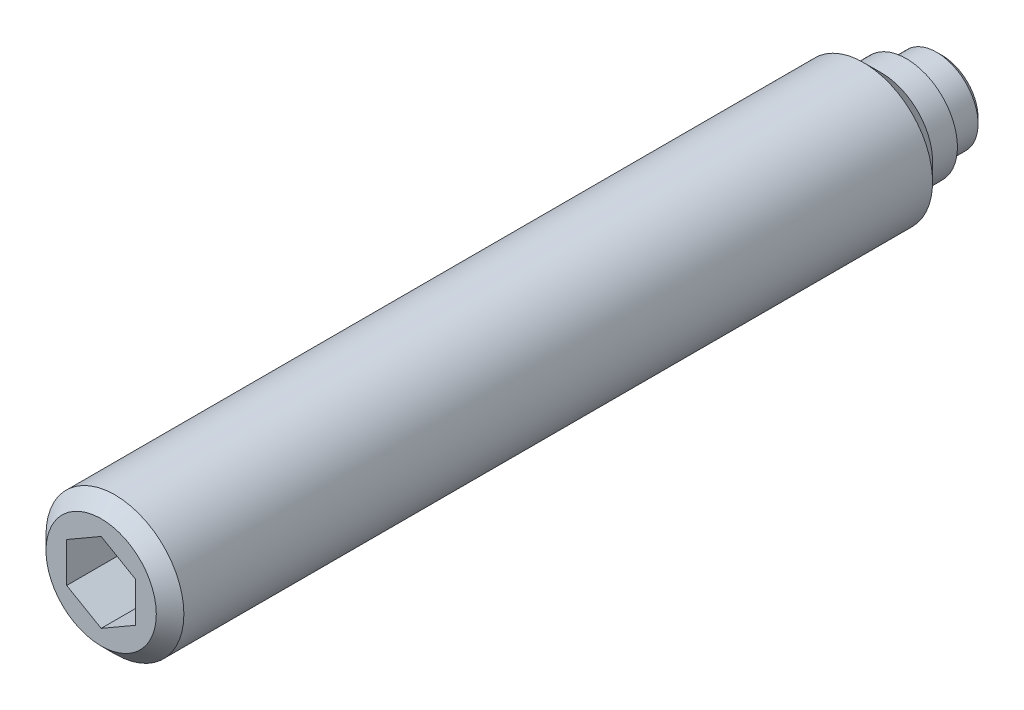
ISO-10303-21;
HEADER;
FILE_DESCRIPTION(('STEP AP214'),'2;1');
FILE_NAME('part.step','',(''),(''),'','','');
FILE_SCHEMA(('AUTOMOTIVE_DESIGN { 1 0 10303 214 1 1 1 1 }'));
ENDSEC;
DATA;
#1=APPLICATION_CONTEXT('core data for automotive mechanical design processes');
#2=APPLICATION_PROTOCOL_DEFINITION('international standard','automotive_design',2000,#1);
#3=PRODUCT_CONTEXT('',#1,'mechanical');
#4=PRODUCT('Part','Part','',(#3));
#5=PRODUCT_RELATED_PRODUCT_CATEGORY('part','',(#4));
#6=PRODUCT_DEFINITION_FORMATION('','',#4);
#7=PRODUCT_DEFINITION_CONTEXT('part definition',#1,'design');
#8=PRODUCT_DEFINITION('design','',#6,#7);
#9=PRODUCT_DEFINITION_SHAPE('','',#8);
#10=(LENGTH_UNIT() NAMED_UNIT(*) SI_UNIT(.MILLI.,.METRE.));
#11=(NAMED_UNIT(*) PLANE_ANGLE_UNIT() SI_UNIT($,.RADIAN.));
#12=(NAMED_UNIT(*) SI_UNIT($,.STERADIAN.) SOLID_ANGLE_UNIT());
#13=UNCERTAINTY_MEASURE_WITH_UNIT(LENGTH_MEASURE(1.E-05),#10,'distance_accuracy_value','');
#14=(GEOMETRIC_REPRESENTATION_CONTEXT(3) GLOBAL_UNCERTAINTY_ASSIGNED_CONTEXT((#13)) GLOBAL_UNIT_ASSIGNED_CONTEXT((#10,
#11,#12)) REPRESENTATION_CONTEXT('',''));
#15=CARTESIAN_POINT('',(0.,0.,0.));
#16=DIRECTION('',(0.,0.,1.));
#17=DIRECTION('',(1.,0.,0.));
#18=AXIS2_PLACEMENT_3D('',#15,#16,#17);
#19=CARTESIAN_POINT('',(0.,0.,1.3));
#20=DIRECTION('',(0.,0.,-1.));
#21=DIRECTION('',(-1.,0.,0.));
#22=AXIS2_PLACEMENT_3D('',#19,#20,#21);
#23=CYLINDRICAL_SURFACE('',#22,2.5);
#24=CARTESIAN_POINT('',(0.,0.,2.85));
#25=DIRECTION('',(0.,0.,-1.));
#26=DIRECTION('',(-1.,0.,0.));
#27=AXIS2_PLACEMENT_3D('',#24,#25,#26);
#28=CIRCLE('',#27,2.5);
#29=CARTESIAN_POINT('',(-2.5,0.,2.85));
#30=VERTEX_POINT('',#29);
#31=EDGE_CURVE('E9',#30,#30,#28,.T.);
#32=ORIENTED_EDGE('',*,*,#31,.F.);
#33=EDGE_LOOP('',(#32));
#34=FACE_BOUND('',#33,.T.);
#35=CARTESIAN_POINT('',(0.,0.,30.));
#36=DIRECTION('',(0.,0.,1.));
#37=DIRECTION('',(1.,0.,0.));
#38=AXIS2_PLACEMENT_3D('',#35,#36,#37);
#39=CIRCLE('',#38,2.5);
#40=CARTESIAN_POINT('',(2.5,0.,30.));
#41=VERTEX_POINT('',#40);
#42=EDGE_CURVE('E115',#41,#41,#39,.T.);
#43=ORIENTED_EDGE('',*,*,#42,.F.);
#44=EDGE_LOOP('',(#43));
#45=FACE_BOUND('',#44,.T.);
#46=ADVANCED_FACE('F14',(#34,#45),#23,.T.);
#47=CARTESIAN_POINT('',(0.,0.,2.85));
#48=DIRECTION('',(0.,0.,1.));
#49=DIRECTION('',(1.,0.,0.));
#50=AXIS2_PLACEMENT_3D('',#47,#48,#49);
#51=CONICAL_SURFACE('',#50,2.5,0.785398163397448);
#52=ORIENTED_EDGE('',*,*,#31,.T.);
#53=EDGE_LOOP('',(#52));
#54=FACE_BOUND('',#53,.T.);
#55=CARTESIAN_POINT('',(0.,0.,2.2));
#56=DIRECTION('',(0.,0.,-1.));
#57=DIRECTION('',(-1.,0.,0.));
#58=AXIS2_PLACEMENT_3D('',#55,#56,#57);
#59=CIRCLE('',#58,1.85);
#60=CARTESIAN_POINT('',(-1.85,0.,2.2));
#61=VERTEX_POINT('',#60);
#62=EDGE_CURVE('E21',#61,#61,#59,.T.);
#63=ORIENTED_EDGE('',*,*,#62,.F.);
#64=EDGE_LOOP('',(#63));
#65=FACE_BOUND('',#64,.T.);
#66=ADVANCED_FACE('F143',(#54,#65),#51,.T.);
#67=CARTESIAN_POINT('',(0.,0.,1.3));
#68=DIRECTION('',(0.,0.,-1.));
#69=DIRECTION('',(-1.,0.,0.));
#70=AXIS2_PLACEMENT_3D('',#67,#68,#69);
#71=CYLINDRICAL_SURFACE('',#70,1.85);
#72=ORIENTED_EDGE('',*,*,#62,.T.);
#73=EDGE_LOOP('',(#72));
#74=FACE_BOUND('',#73,.T.);
#75=CARTESIAN_POINT('',(0.,0.,1.3));
#76=DIRECTION('',(0.,0.,-1.));
#77=DIRECTION('',(-1.,0.,0.));
#78=AXIS2_PLACEMENT_3D('',#75,#76,#77);
#79=CIRCLE('',#78,1.85);
#80=CARTESIAN_POINT('',(-1.85,0.,1.3));
#81=VERTEX_POINT('',#80);
#82=EDGE_CURVE('E135',#81,#81,#79,.T.);
#83=ORIENTED_EDGE('',*,*,#82,.F.);
#84=EDGE_LOOP('',(#83));
#85=FACE_BOUND('',#84,.T.);
#86=ADVANCED_FACE('F140',(#74,#85),#71,.T.);
#87=CARTESIAN_POINT('',(0.,1.85,1.3));
#88=DIRECTION('',(0.,0.,1.));
#89=DIRECTION('',(1.,0.,0.));
#90=AXIS2_PLACEMENT_3D('',#87,#88,#89);
#91=PLANE('',#90);
#92=ORIENTED_EDGE('',*,*,#82,.T.);
#93=EDGE_LOOP('',(#92));
#94=FACE_BOUND('',#93,.T.);
#95=CARTESIAN_POINT('',(0.,0.,1.3));
#96=DIRECTION('',(0.,0.,-1.));
#97=DIRECTION('',(-1.,0.,0.));
#98=AXIS2_PLACEMENT_3D('',#95,#96,#97);
#99=CIRCLE('',#98,1.5);
#100=CARTESIAN_POINT('',(-1.5,0.,1.3));
#101=VERTEX_POINT('',#100);
#102=EDGE_CURVE('E132',#101,#101,#99,.T.);
#103=ORIENTED_EDGE('',*,*,#102,.F.);
#104=EDGE_LOOP('',(#103));
#105=FACE_BOUND('',#104,.T.);
#106=ADVANCED_FACE('F151',(#94,#105),#91,.F.);
#107=CARTESIAN_POINT('',(0.,0.,0.));
#108=DIRECTION('',(0.,0.,-1.));
#109=DIRECTION('',(-1.,0.,0.));
#110=AXIS2_PLACEMENT_3D('',#107,#108,#109);
#111=CYLINDRICAL_SURFACE('',#110,1.5);
#112=CARTESIAN_POINT('',(0.,0.,0.2));
#113=DIRECTION('',(0.,0.,-1.));
#114=DIRECTION('',(-1.,0.,0.));
#115=AXIS2_PLACEMENT_3D('',#112,#113,#114);
#116=CIRCLE('',#115,1.5);
#117=CARTESIAN_POINT('',(-1.5,0.,0.2));
#118=VERTEX_POINT('',#117);
#119=EDGE_CURVE('E129',#118,#118,#116,.T.);
#120=ORIENTED_EDGE('',*,*,#119,.F.);
#121=EDGE_LOOP('',(#120));
#122=FACE_BOUND('',#121,.T.);
#123=ORIENTED_EDGE('',*,*,#102,.T.);
#124=EDGE_LOOP('',(#123));
#125=FACE_BOUND('',#124,.T.);
#126=ADVANCED_FACE('F157',(#122,#125),#111,.T.);
#127=CARTESIAN_POINT('',(0.,0.,0.2));
#128=DIRECTION('',(0.,0.,1.));
#129=DIRECTION('',(1.,0.,0.));
#130=AXIS2_PLACEMENT_3D('',#127,#128,#129);
#131=CONICAL_SURFACE('',#130,1.5,0.785398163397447);
#132=CARTESIAN_POINT('',(0.,0.,0.));
#133=DIRECTION('',(0.,0.,-1.));
#134=DIRECTION('',(-1.,0.,0.));
#135=AXIS2_PLACEMENT_3D('',#132,#133,#134);
#136=CIRCLE('',#135,1.3);
#137=CARTESIAN_POINT('',(-1.3,0.,0.));
#138=VERTEX_POINT('',#137);
#139=EDGE_CURVE('E126',#138,#138,#136,.T.);
#140=ORIENTED_EDGE('',*,*,#139,.F.);
#141=EDGE_LOOP('',(#140));
#142=FACE_BOUND('',#141,.T.);
#143=ORIENTED_EDGE('',*,*,#119,.T.);
#144=EDGE_LOOP('',(#143));
#145=FACE_BOUND('',#144,.T.);
#146=ADVANCED_FACE('F161',(#142,#145),#131,.T.);
#147=CARTESIAN_POINT('',(0.,1.3,0.));
#148=DIRECTION('',(0.,0.,1.));
#149=DIRECTION('',(1.,0.,0.));
#150=AXIS2_PLACEMENT_3D('',#147,#148,#149);
#151=PLANE('',#150);
#152=ORIENTED_EDGE('',*,*,#139,.T.);
#153=EDGE_LOOP('',(#152));
#154=FACE_BOUND('',#153,.T.);
#155=ADVANCED_FACE('F165',(#154),#151,.F.);
#156=CARTESIAN_POINT('',(0.,0.,30.5));
#157=DIRECTION('',(0.,0.,1.));
#158=DIRECTION('',(1.,0.,0.));
#159=AXIS2_PLACEMENT_3D('',#156,#157,#158);
#160=PLANE('',#159);
#161=DIRECTION('',(0.866025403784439,-0.5,0.));
#162=VECTOR('',#161,1.);
#163=CARTESIAN_POINT('',(-1.25,-0.721687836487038,30.5));
#164=LINE('',#163,#162);
#165=CARTESIAN_POINT('',(-1.25,-0.721687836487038,30.5));
#166=VERTEX_POINT('',#165);
#167=CARTESIAN_POINT('',(0.,-1.44337567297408,30.5));
#168=VERTEX_POINT('',#167);
#169=EDGE_CURVE('E28',#166,#168,#164,.T.);
#170=ORIENTED_EDGE('',*,*,#169,.F.);
#171=DIRECTION('',(0.,-1.,0.));
#172=VECTOR('',#171,1.);
#173=CARTESIAN_POINT('',(-1.25,0.721687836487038,30.5));
#174=LINE('',#173,#172);
#175=CARTESIAN_POINT('',(-1.25,0.721687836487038,30.5));
#176=VERTEX_POINT('',#175);
#177=EDGE_CURVE('E111',#176,#166,#174,.T.);
#178=ORIENTED_EDGE('',*,*,#177,.F.);
#179=DIRECTION('',(-0.866025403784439,-0.5,0.));
#180=VECTOR('',#179,1.);
#181=CARTESIAN_POINT('',(0.,1.44337567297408,30.5));
#182=LINE('',#181,#180);
#183=CARTESIAN_POINT('',(0.,1.44337567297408,30.5));
#184=VERTEX_POINT('',#183);
#185=EDGE_CURVE('E109',#184,#176,#182,.T.);
#186=ORIENTED_EDGE('',*,*,#185,.F.);
#187=DIRECTION('',(-0.866025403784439,0.5,0.));
#188=VECTOR('',#187,1.);
#189=CARTESIAN_POINT('',(1.25,0.721687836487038,30.5));
#190=LINE('',#189,#188);
#191=CARTESIAN_POINT('',(1.25,0.721687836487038,30.5));
#192=VERTEX_POINT('',#191);
#193=EDGE_CURVE('E76',#192,#184,#190,.T.);
#194=ORIENTED_EDGE('',*,*,#193,.F.);
#195=DIRECTION('',(0.,1.,0.));
#196=VECTOR('',#195,1.);
#197=CARTESIAN_POINT('',(1.25,-0.721687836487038,30.5));
#198=LINE('',#197,#196);
#199=CARTESIAN_POINT('',(1.25,-0.721687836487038,30.5));
#200=VERTEX_POINT('',#199);
#201=EDGE_CURVE('E105',#200,#192,#198,.T.);
#202=ORIENTED_EDGE('',*,*,#201,.F.);
#203=DIRECTION('',(0.866025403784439,0.5,0.));
#204=VECTOR('',#203,1.);
#205=CARTESIAN_POINT('',(0.,-1.44337567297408,30.5));
#206=LINE('',#205,#204);
#207=EDGE_CURVE('E102',#168,#200,#206,.T.);
#208=ORIENTED_EDGE('',*,*,#207,.F.);
#209=EDGE_LOOP('',(#170,#178,#186,#194,#202,#208));
#210=FACE_BOUND('',#209,.T.);
#211=CARTESIAN_POINT('',(0.,0.,30.5));
#212=DIRECTION('',(0.,0.,1.));
#213=DIRECTION('',(1.,0.,0.));
#214=AXIS2_PLACEMENT_3D('',#211,#212,#213);
#215=CIRCLE('',#214,2.);
#216=CARTESIAN_POINT('',(2.,0.,30.5));
#217=VERTEX_POINT('',#216);
#218=EDGE_CURVE('E123',#217,#217,#215,.T.);
#219=ORIENTED_EDGE('',*,*,#218,.T.);
#220=EDGE_LOOP('',(#219));
#221=FACE_BOUND('',#220,.T.);
#222=ADVANCED_FACE('F169',(#210,#221),#160,.T.);
#223=CARTESIAN_POINT('',(0.,0.,30.5));
#224=DIRECTION('',(0.,0.,-1.));
#225=DIRECTION('',(-1.,0.,0.));
#226=AXIS2_PLACEMENT_3D('',#223,#224,#225);
#227=CONICAL_SURFACE('',#226,2.,0.785398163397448);
#228=ORIENTED_EDGE('',*,*,#42,.T.);
#229=EDGE_LOOP('',(#228));
#230=FACE_BOUND('',#229,.T.);
#231=ORIENTED_EDGE('',*,*,#218,.F.);
#232=EDGE_LOOP('',(#231));
#233=FACE_BOUND('',#232,.T.);
#234=ADVANCED_FACE('F173',(#230,#233),#227,.T.);
#235=CARTESIAN_POINT('',(-1.25,-0.721687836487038,27.5));
#236=DIRECTION('',(-0.5,-0.866025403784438,0.));
#237=DIRECTION('',(0.866025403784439,-0.5,0.));
#238=AXIS2_PLACEMENT_3D('',#235,#236,#237);
#239=PLANE('',#238);
#240=ORIENTED_EDGE('',*,*,#169,.T.);
#241=DIRECTION('',(0.,0.,1.));
#242=VECTOR('',#241,1.);
#243=CARTESIAN_POINT('',(0.,-1.44337567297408,27.5));
#244=LINE('',#243,#242);
#245=CARTESIAN_POINT('',(0.,-1.44337567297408,27.5));
#246=VERTEX_POINT('',#245);
#247=EDGE_CURVE('E58',#246,#168,#244,.T.);
#248=ORIENTED_EDGE('',*,*,#247,.F.);
#249=DIRECTION('',(0.866025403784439,-0.5,0.));
#250=VECTOR('',#249,1.);
#251=CARTESIAN_POINT('',(-1.25,-0.721687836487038,27.5));
#252=LINE('',#251,#250);
#253=CARTESIAN_POINT('',(-1.25,-0.721687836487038,27.5));
#254=VERTEX_POINT('',#253);
#255=EDGE_CURVE('E113',#254,#246,#252,.T.);
#256=ORIENTED_EDGE('',*,*,#255,.F.);
#257=DIRECTION('',(0.,0.,1.));
#258=VECTOR('',#257,1.);
#259=CARTESIAN_POINT('',(-1.25,-0.721687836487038,27.5));
#260=LINE('',#259,#258);
#261=EDGE_CURVE('E36',#254,#166,#260,.T.);
#262=ORIENTED_EDGE('',*,*,#261,.T.);
#263=EDGE_LOOP('',(#240,#248,#256,#262));
#264=FACE_BOUND('',#263,.T.);
#265=ADVANCED_FACE('F177',(#264),#239,.F.);
#266=CARTESIAN_POINT('',(-1.25,0.721687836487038,27.5));
#267=DIRECTION('',(-1.,0.,0.));
#268=DIRECTION('',(0.,0.,1.));
#269=AXIS2_PLACEMENT_3D('',#266,#267,#268);
#270=PLANE('',#269);
#271=ORIENTED_EDGE('',*,*,#177,.T.);
#272=ORIENTED_EDGE('',*,*,#261,.F.);
#273=DIRECTION('',(0.,-1.,0.));
#274=VECTOR('',#273,1.);
#275=CARTESIAN_POINT('',(-1.25,0.721687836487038,27.5));
#276=LINE('',#275,#274);
#277=CARTESIAN_POINT('',(-1.25,0.721687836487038,27.5));
#278=VERTEX_POINT('',#277);
#279=EDGE_CURVE('E88',#278,#254,#276,.T.);
#280=ORIENTED_EDGE('',*,*,#279,.F.);
#281=DIRECTION('',(0.,0.,1.));
#282=VECTOR('',#281,1.);
#283=CARTESIAN_POINT('',(-1.25,0.721687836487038,27.5));
#284=LINE('',#283,#282);
#285=EDGE_CURVE('E80',#278,#176,#284,.T.);
#286=ORIENTED_EDGE('',*,*,#285,.T.);
#287=EDGE_LOOP('',(#271,#272,#280,#286));
#288=FACE_BOUND('',#287,.T.);
#289=ADVANCED_FACE('F181',(#288),#270,.F.);
#290=CARTESIAN_POINT('',(0.,1.44337567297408,27.5));
#291=DIRECTION('',(-0.5,0.866025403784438,0.));
#292=DIRECTION('',(-0.866025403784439,-0.5,0.));
#293=AXIS2_PLACEMENT_3D('',#290,#291,#292);
#294=PLANE('',#293);
#295=ORIENTED_EDGE('',*,*,#185,.T.);
#296=ORIENTED_EDGE('',*,*,#285,.F.);
#297=DIRECTION('',(-0.866025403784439,-0.5,0.));
#298=VECTOR('',#297,1.);
#299=CARTESIAN_POINT('',(0.,1.44337567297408,27.5));
#300=LINE('',#299,#298);
#301=CARTESIAN_POINT('',(0.,1.44337567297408,27.5));
#302=VERTEX_POINT('',#301);
#303=EDGE_CURVE('E84',#302,#278,#300,.T.);
#304=ORIENTED_EDGE('',*,*,#303,.F.);
#305=DIRECTION('',(0.,0.,1.));
#306=VECTOR('',#305,1.);
#307=CARTESIAN_POINT('',(0.,1.44337567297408,27.5));
#308=LINE('',#307,#306);
#309=EDGE_CURVE('E69',#302,#184,#308,.T.);
#310=ORIENTED_EDGE('',*,*,#309,.T.);
#311=EDGE_LOOP('',(#295,#296,#304,#310));
#312=FACE_BOUND('',#311,.T.);
#313=ADVANCED_FACE('F85',(#312),#294,.F.);
#314=CARTESIAN_POINT('',(1.25,0.721687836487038,27.5));
#315=DIRECTION('',(0.5,0.866025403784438,0.));
#316=DIRECTION('',(-0.866025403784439,0.5,0.));
#317=AXIS2_PLACEMENT_3D('',#314,#315,#316);
#318=PLANE('',#317);
#319=ORIENTED_EDGE('',*,*,#193,.T.);
#320=ORIENTED_EDGE('',*,*,#309,.F.);
#321=DIRECTION('',(-0.866025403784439,0.5,0.));
#322=VECTOR('',#321,1.);
#323=CARTESIAN_POINT('',(1.25,0.721687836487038,27.5));
#324=LINE('',#323,#322);
#325=CARTESIAN_POINT('',(1.25,0.721687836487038,27.5));
#326=VERTEX_POINT('',#325);
#327=EDGE_CURVE('E73',#326,#302,#324,.T.);
#328=ORIENTED_EDGE('',*,*,#327,.F.);
#329=DIRECTION('',(0.,0.,1.));
#330=VECTOR('',#329,1.);
#331=CARTESIAN_POINT('',(1.25,0.721687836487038,27.5));
#332=LINE('',#331,#330);
#333=EDGE_CURVE('E81',#326,#192,#332,.T.);
#334=ORIENTED_EDGE('',*,*,#333,.T.);
#335=EDGE_LOOP('',(#319,#320,#328,#334));
#336=FACE_BOUND('',#335,.T.);
#337=ADVANCED_FACE('F71',(#336),#318,.F.);
#338=CARTESIAN_POINT('',(1.25,-0.721687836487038,27.5));
#339=DIRECTION('',(1.,0.,0.));
#340=DIRECTION('',(0.,0.,-1.));
#341=AXIS2_PLACEMENT_3D('',#338,#339,#340);
#342=PLANE('',#341);
#343=ORIENTED_EDGE('',*,*,#201,.T.);
#344=ORIENTED_EDGE('',*,*,#333,.F.);
#345=DIRECTION('',(0.,1.,0.));
#346=VECTOR('',#345,1.);
#347=CARTESIAN_POINT('',(1.25,-0.721687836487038,27.5));
#348=LINE('',#347,#346);
#349=CARTESIAN_POINT('',(1.25,-0.721687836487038,27.5));
#350=VERTEX_POINT('',#349);
#351=EDGE_CURVE('E94',#350,#326,#348,.T.);
#352=ORIENTED_EDGE('',*,*,#351,.F.);
#353=DIRECTION('',(0.,0.,1.));
#354=VECTOR('',#353,1.);
#355=CARTESIAN_POINT('',(1.25,-0.721687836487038,27.5));
#356=LINE('',#355,#354);
#357=EDGE_CURVE('E118',#350,#200,#356,.T.);
#358=ORIENTED_EDGE('',*,*,#357,.T.);
#359=EDGE_LOOP('',(#343,#344,#352,#358));
#360=FACE_BOUND('',#359,.T.);
#361=ADVANCED_FACE('F185',(#360),#342,.F.);
#362=CARTESIAN_POINT('',(0.,-1.44337567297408,27.5));
#363=DIRECTION('',(0.5,-0.866025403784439,0.));
#364=DIRECTION('',(0.866025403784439,0.5,0.));
#365=AXIS2_PLACEMENT_3D('',#362,#363,#364);
#366=PLANE('',#365);
#367=ORIENTED_EDGE('',*,*,#207,.T.);
#368=ORIENTED_EDGE('',*,*,#357,.F.);
#369=DIRECTION('',(0.866025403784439,0.5,0.));
#370=VECTOR('',#369,1.);
#371=CARTESIAN_POINT('',(0.,-1.44337567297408,27.5));
#372=LINE('',#371,#370);
#373=EDGE_CURVE('E96',#246,#350,#372,.T.);
#374=ORIENTED_EDGE('',*,*,#373,.F.);
#375=ORIENTED_EDGE('',*,*,#247,.T.);
#376=EDGE_LOOP('',(#367,#368,#374,#375));
#377=FACE_BOUND('',#376,.T.);
#378=ADVANCED_FACE('F182',(#377),#366,.F.);
#379=CARTESIAN_POINT('',(0.,0.,27.5));
#380=DIRECTION('',(0.,0.,1.));
#381=DIRECTION('',(1.,0.,0.));
#382=AXIS2_PLACEMENT_3D('',#379,#380,#381);
#383=PLANE('',#382);
#384=ORIENTED_EDGE('',*,*,#255,.T.);
#385=ORIENTED_EDGE('',*,*,#373,.T.);
#386=ORIENTED_EDGE('',*,*,#351,.T.);
#387=ORIENTED_EDGE('',*,*,#327,.T.);
#388=ORIENTED_EDGE('',*,*,#303,.T.);
#389=ORIENTED_EDGE('',*,*,#279,.T.);
#390=EDGE_LOOP('',(#384,#385,#386,#387,#388,#389));
#391=FACE_BOUND('',#390,.T.);
#392=ADVANCED_FACE('F91',(#391),#383,.T.);
#393=CLOSED_SHELL('',(#46,#66,#86,#106,#126,#146,#155,#222,#234,#265,#289,#313,#337,#361,#378,#392));
#394=MANIFOLD_SOLID_BREP('B1',#393);
#395=ADVANCED_BREP_SHAPE_REPRESENTATION('',(#18,#394),#14);
#396=SHAPE_DEFINITION_REPRESENTATION(#9,#395);
ENDSEC;
END-ISO-10303-21;
